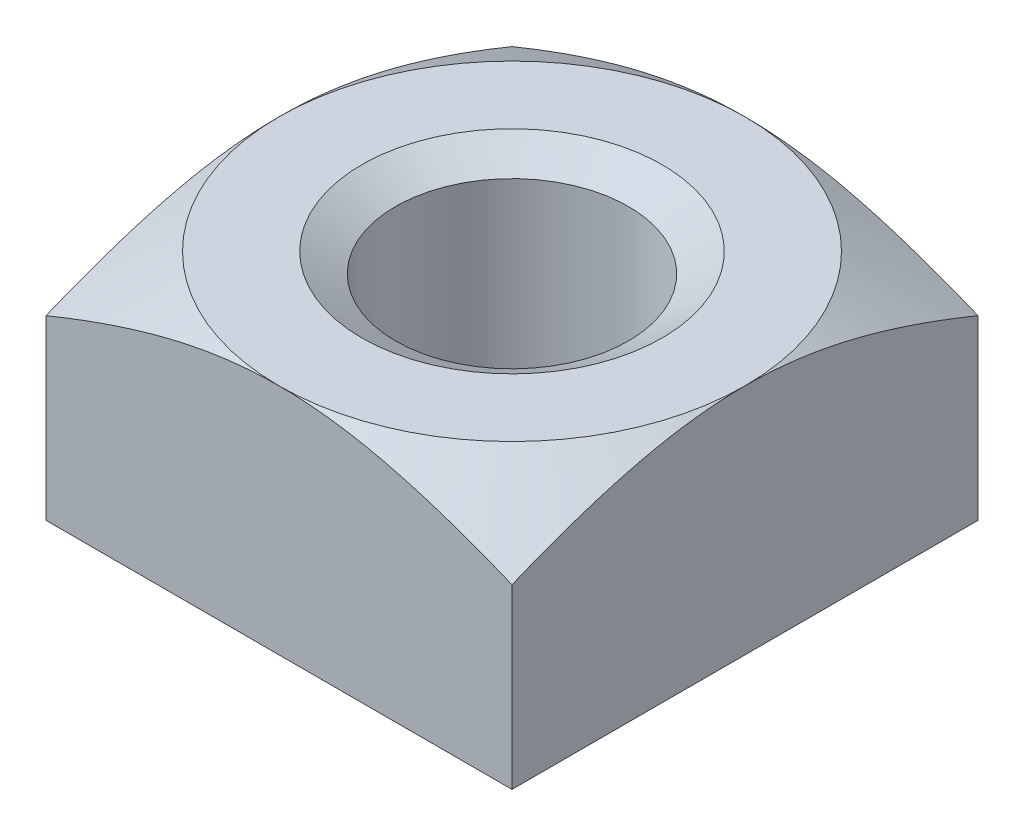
from build123d import *

# Parameters (mm, degrees)
BASENUTSKE_W     = 10
BASENUTSKE_H     = 10
BASENUT_DEPTH    = 5
HOLESKE_R        = 2.5
TAPPEDHOLE_DEPTH = 9.660254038
CHAMFER1_SIZE    = 0.416666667
CHAMFER1_SIZE2   = 0.721687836


with BuildPart() as part:
    # BaseNutSke → BaseNut (new body)
    with BuildSketch(Plane(origin=(0, 0, 0), x_dir=(1, 0, 0), z_dir=(0, 1, 0))):
        Rectangle(BASENUTSKE_W, BASENUTSKE_H)
    extrude(amount=BASENUT_DEPTH)

    # CutNutSke → CutNut (revolve, cut)
    with BuildSketch(Plane.XY):
        Polygon((5, 5), (13.660254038, 5), (13.660254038, 0), align=None)
    revolve(axis=Axis((0, 0, 0), (0, 1, 0)), mode=Mode.SUBTRACT)

    # HoleSke → TappedHole (cut, through all)
    with BuildSketch(Plane(origin=(0, 5, 0), x_dir=(1, 0, 0), z_dir=(0, 1, 0))):
        with Locations(Location((0, 0, 0), (0, 0, 270))):
            Circle(HOLESKE_R)
    extrude(amount=-TAPPEDHOLE_DEPTH, mode=Mode.SUBTRACT)

    # Chamfer1
    chamfer1_edges = [part.edges().sort_by_distance(p)[0] for p in [
        (0, 0, -2.5),
        (0, 5, -2.5),
    ]]
    chamfer1_side = [part.faces().sort_by_distance(p)[0] for p in [
        (0, 2.5, -2.5),
    ]]
    chamfer(chamfer1_edges, length=CHAMFER1_SIZE, length2=CHAMFER1_SIZE2, reference=chamfer1_side[0])


solid = part.part
